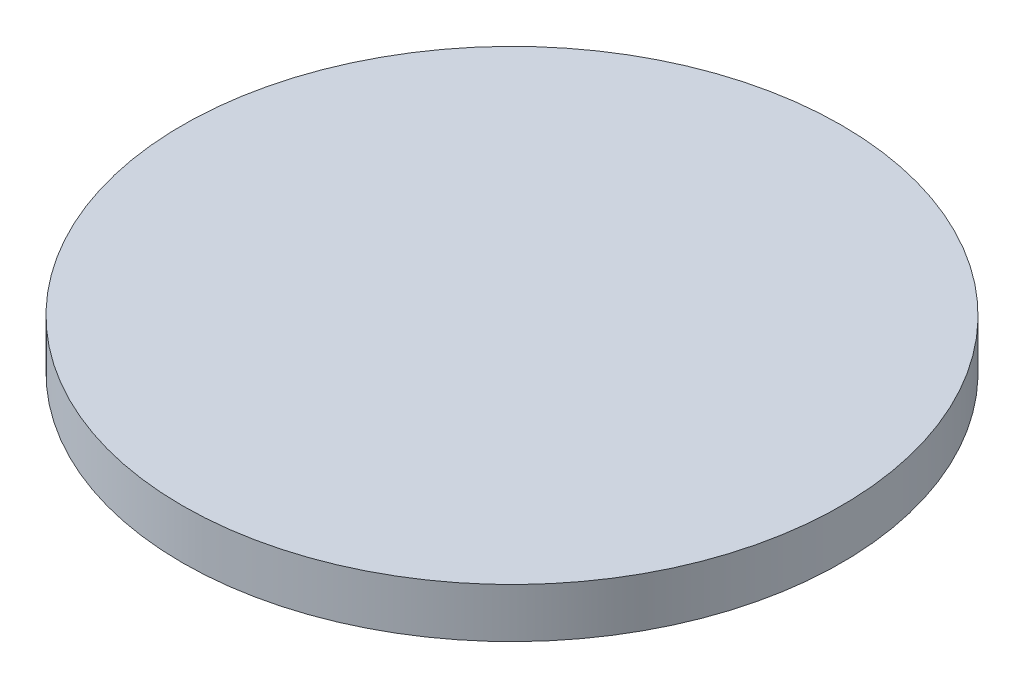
ISO-10303-21;
HEADER;
FILE_DESCRIPTION(('STEP AP214'),'2;1');
FILE_NAME('part.step','',(''),(''),'','','');
FILE_SCHEMA(('AUTOMOTIVE_DESIGN { 1 0 10303 214 1 1 1 1 }'));
ENDSEC;
DATA;
#1=APPLICATION_CONTEXT('core data for automotive mechanical design processes');
#2=APPLICATION_PROTOCOL_DEFINITION('international standard','automotive_design',2000,#1);
#3=PRODUCT_CONTEXT('',#1,'mechanical');
#4=PRODUCT('Part','Part','',(#3));
#5=PRODUCT_RELATED_PRODUCT_CATEGORY('part','',(#4));
#6=PRODUCT_DEFINITION_FORMATION('','',#4);
#7=PRODUCT_DEFINITION_CONTEXT('part definition',#1,'design');
#8=PRODUCT_DEFINITION('design','',#6,#7);
#9=PRODUCT_DEFINITION_SHAPE('','',#8);
#10=(LENGTH_UNIT() NAMED_UNIT(*) SI_UNIT(.MILLI.,.METRE.));
#11=(NAMED_UNIT(*) PLANE_ANGLE_UNIT() SI_UNIT($,.RADIAN.));
#12=(NAMED_UNIT(*) SI_UNIT($,.STERADIAN.) SOLID_ANGLE_UNIT());
#13=UNCERTAINTY_MEASURE_WITH_UNIT(LENGTH_MEASURE(1.E-05),#10,'distance_accuracy_value','');
#14=(GEOMETRIC_REPRESENTATION_CONTEXT(3) GLOBAL_UNCERTAINTY_ASSIGNED_CONTEXT((#13)) GLOBAL_UNIT_ASSIGNED_CONTEXT((#10,
#11,#12)) REPRESENTATION_CONTEXT('',''));
#15=CARTESIAN_POINT('',(0.,0.,0.));
#16=DIRECTION('',(0.,0.,1.));
#17=DIRECTION('',(1.,0.,0.));
#18=AXIS2_PLACEMENT_3D('',#15,#16,#17);
#19=CARTESIAN_POINT('',(0.,4.41,0.));
#20=DIRECTION('',(0.,-1.,0.));
#21=DIRECTION('',(0.,0.,-1.));
#22=AXIS2_PLACEMENT_3D('',#19,#20,#21);
#23=CYLINDRICAL_SURFACE('',#22,29.38);
#24=CARTESIAN_POINT('',(0.,4.41,0.));
#25=DIRECTION('',(0.,1.,0.));
#26=DIRECTION('',(0.,0.,1.));
#27=AXIS2_PLACEMENT_3D('',#24,#25,#26);
#28=CIRCLE('',#27,29.38);
#29=CARTESIAN_POINT('',(0.,4.41,29.38));
#30=VERTEX_POINT('',#29);
#31=EDGE_CURVE('E10',#30,#30,#28,.T.);
#32=ORIENTED_EDGE('',*,*,#31,.F.);
#33=EDGE_LOOP('',(#32));
#34=FACE_BOUND('',#33,.T.);
#35=CARTESIAN_POINT('',(0.,0.,0.));
#36=DIRECTION('',(0.,1.,0.));
#37=DIRECTION('',(0.,0.,1.));
#38=AXIS2_PLACEMENT_3D('',#35,#36,#37);
#39=CIRCLE('',#38,29.38);
#40=CARTESIAN_POINT('',(0.,0.,29.38));
#41=VERTEX_POINT('',#40);
#42=EDGE_CURVE('E46',#41,#41,#39,.T.);
#43=ORIENTED_EDGE('',*,*,#42,.T.);
#44=EDGE_LOOP('',(#43));
#45=FACE_BOUND('',#44,.T.);
#46=ADVANCED_FACE('F43',(#34,#45),#23,.T.);
#47=CARTESIAN_POINT('',(0.,4.41,0.));
#48=DIRECTION('',(0.,1.,0.));
#49=DIRECTION('',(0.,0.,1.));
#50=AXIS2_PLACEMENT_3D('',#47,#48,#49);
#51=PLANE('',#50);
#52=ORIENTED_EDGE('',*,*,#31,.T.);
#53=EDGE_LOOP('',(#52));
#54=FACE_BOUND('',#53,.T.);
#55=ADVANCED_FACE('F60',(#54),#51,.T.);
#56=CARTESIAN_POINT('',(0.,0.,0.));
#57=DIRECTION('',(0.,1.,0.));
#58=DIRECTION('',(0.,0.,1.));
#59=AXIS2_PLACEMENT_3D('',#56,#57,#58);
#60=PLANE('',#59);
#61=ORIENTED_EDGE('',*,*,#42,.F.);
#62=EDGE_LOOP('',(#61));
#63=FACE_BOUND('',#62,.T.);
#64=ADVANCED_FACE('F58',(#63),#60,.F.);
#65=CLOSED_SHELL('',(#46,#55,#64));
#66=MANIFOLD_SOLID_BREP('B2',#65);
#67=ADVANCED_BREP_SHAPE_REPRESENTATION('',(#18,#66),#14);
#68=SHAPE_DEFINITION_REPRESENTATION(#9,#67);
ENDSEC;
END-ISO-10303-21;
